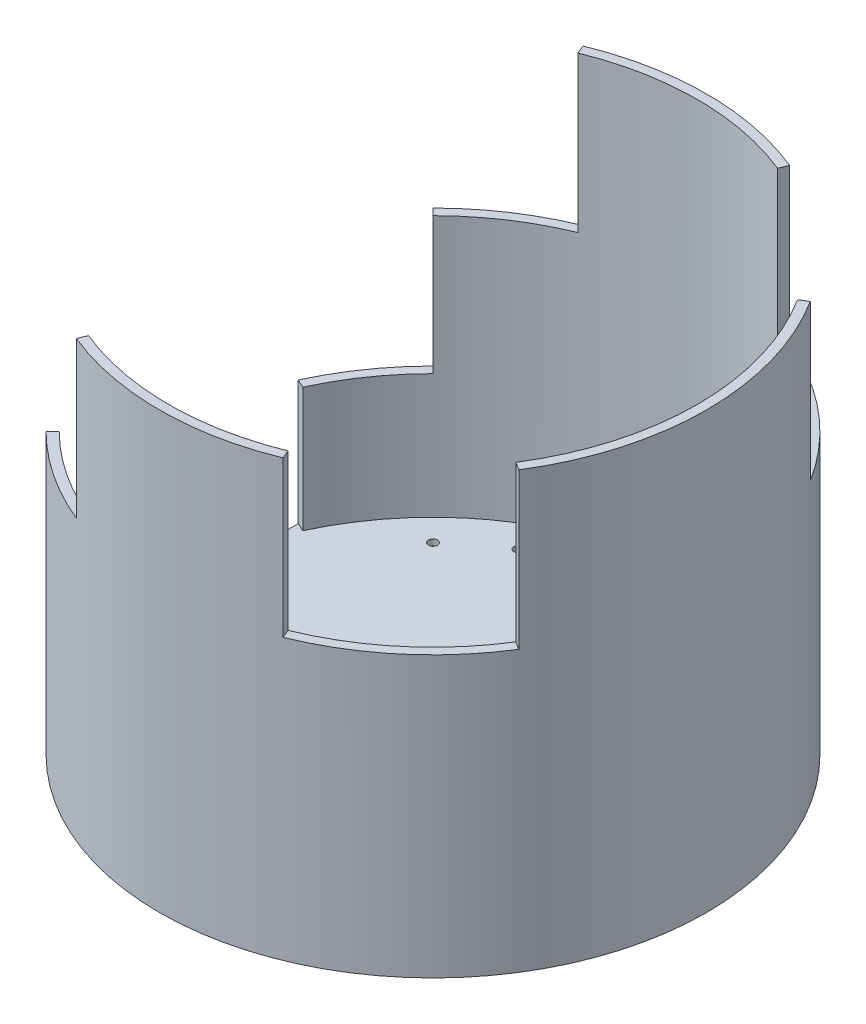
ISO-10303-21;
HEADER;
FILE_DESCRIPTION(('STEP AP214'),'2;1');
FILE_NAME('part.step','',(''),(''),'','','');
FILE_SCHEMA(('AUTOMOTIVE_DESIGN { 1 0 10303 214 1 1 1 1 }'));
ENDSEC;
DATA;
#1=APPLICATION_CONTEXT('core data for automotive mechanical design processes');
#2=APPLICATION_PROTOCOL_DEFINITION('international standard','automotive_design',2000,#1);
#3=PRODUCT_CONTEXT('',#1,'mechanical');
#4=PRODUCT('Part','Part','',(#3));
#5=PRODUCT_RELATED_PRODUCT_CATEGORY('part','',(#4));
#6=PRODUCT_DEFINITION_FORMATION('','',#4);
#7=PRODUCT_DEFINITION_CONTEXT('part definition',#1,'design');
#8=PRODUCT_DEFINITION('design','',#6,#7);
#9=PRODUCT_DEFINITION_SHAPE('','',#8);
#10=(LENGTH_UNIT() NAMED_UNIT(*) SI_UNIT(.MILLI.,.METRE.));
#11=(NAMED_UNIT(*) PLANE_ANGLE_UNIT() SI_UNIT($,.RADIAN.));
#12=(NAMED_UNIT(*) SI_UNIT($,.STERADIAN.) SOLID_ANGLE_UNIT());
#13=UNCERTAINTY_MEASURE_WITH_UNIT(LENGTH_MEASURE(1.E-05),#10,'distance_accuracy_value','');
#14=(GEOMETRIC_REPRESENTATION_CONTEXT(3) GLOBAL_UNCERTAINTY_ASSIGNED_CONTEXT((#13)) GLOBAL_UNIT_ASSIGNED_CONTEXT((#10,
#11,#12)) REPRESENTATION_CONTEXT('',''));
#15=CARTESIAN_POINT('',(0.,0.,0.));
#16=DIRECTION('',(0.,0.,1.));
#17=DIRECTION('',(1.,0.,0.));
#18=AXIS2_PLACEMENT_3D('',#15,#16,#17);
#19=CARTESIAN_POINT('',(-80.,159.371915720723,36.6606055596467));
#20=DIRECTION('',(1.,0.,0.));
#21=DIRECTION('',(0.,0.,-1.));
#22=AXIS2_PLACEMENT_3D('',#19,#20,#21);
#23=PLANE('',#22);
#24=DIRECTION('',(0.,0.,-1.));
#25=VECTOR('',#24,1.);
#26=CARTESIAN_POINT('',(-80.,6.00000000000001,-36.6606055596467));
#27=LINE('',#26,#25);
#28=CARTESIAN_POINT('',(-80.,6.00000000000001,36.6606055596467));
#29=VERTEX_POINT('',#28);
#30=CARTESIAN_POINT('',(-80.,5.99999999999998,-36.6606055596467));
#31=VERTEX_POINT('',#30);
#32=EDGE_CURVE('E227',#29,#31,#27,.T.);
#33=ORIENTED_EDGE('',*,*,#32,.T.);
#34=DIRECTION('',(0.,1.,0.));
#35=VECTOR('',#34,1.);
#36=CARTESIAN_POINT('',(-80.,0.,-36.6606055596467));
#37=LINE('',#36,#35);
#38=CARTESIAN_POINT('',(-80.,0.,-36.6606055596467));
#39=VERTEX_POINT('',#38);
#40=EDGE_CURVE('E288',#39,#31,#37,.T.);
#41=ORIENTED_EDGE('',*,*,#40,.F.);
#42=DIRECTION('',(0.,0.,1.));
#43=VECTOR('',#42,1.);
#44=CARTESIAN_POINT('',(-80.,0.,36.6606055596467));
#45=LINE('',#44,#43);
#46=CARTESIAN_POINT('',(-80.,0.,36.6606055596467));
#47=VERTEX_POINT('',#46);
#48=EDGE_CURVE('E279',#39,#47,#45,.T.);
#49=ORIENTED_EDGE('',*,*,#48,.T.);
#50=DIRECTION('',(0.,1.,0.));
#51=VECTOR('',#50,1.);
#52=CARTESIAN_POINT('',(-80.,0.,36.6606055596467));
#53=LINE('',#52,#51);
#54=EDGE_CURVE('E283',#47,#29,#53,.T.);
#55=ORIENTED_EDGE('',*,*,#54,.T.);
#56=EDGE_LOOP('',(#33,#41,#49,#55));
#57=FACE_BOUND('',#56,.T.);
#58=ADVANCED_FACE('F40',(#57),#23,.F.);
#59=CARTESIAN_POINT('',(0.,46.,0.));
#60=DIRECTION('',(0.,1.,0.));
#61=DIRECTION('',(0.,0.,1.));
#62=AXIS2_PLACEMENT_3D('',#59,#60,#61);
#63=PLANE('',#62);
#64=DIRECTION('',(0.909090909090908,0.,-0.416597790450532));
#65=VECTOR('',#64,1.);
#66=CARTESIAN_POINT('',(-80.,46.,36.6606055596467));
#67=LINE('',#66,#65);
#68=CARTESIAN_POINT('',(-80.,46.,36.6606055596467));
#69=VERTEX_POINT('',#68);
#70=CARTESIAN_POINT('',(-77.2727272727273,46.,35.4108121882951));
#71=VERTEX_POINT('',#70);
#72=EDGE_CURVE('E238',#69,#71,#67,.T.);
#73=ORIENTED_EDGE('',*,*,#72,.F.);
#74=CARTESIAN_POINT('',(0.,46.,0.));
#75=DIRECTION('',(0.,1.,0.));
#76=DIRECTION('',(0.,0.,1.));
#77=AXIS2_PLACEMENT_3D('',#74,#75,#76);
#78=CIRCLE('',#77,88.);
#79=CARTESIAN_POINT('',(-62.2253967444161,46.,62.2253967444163));
#80=VERTEX_POINT('',#79);
#81=EDGE_CURVE('E259',#69,#80,#78,.T.);
#82=ORIENTED_EDGE('',*,*,#81,.T.);
#83=DIRECTION('',(-0.707106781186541,0.,0.707106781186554));
#84=VECTOR('',#83,1.);
#85=CARTESIAN_POINT('',(-60.1040764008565,46.,60.1040764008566));
#86=LINE('',#85,#84);
#87=CARTESIAN_POINT('',(-60.1040764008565,46.,60.1040764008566));
#88=VERTEX_POINT('',#87);
#89=EDGE_CURVE('E254',#88,#80,#86,.T.);
#90=ORIENTED_EDGE('',*,*,#89,.F.);
#91=CARTESIAN_POINT('',(0.,46.,0.));
#92=DIRECTION('',(0.,1.,0.));
#93=DIRECTION('',(0.,0.,1.));
#94=AXIS2_PLACEMENT_3D('',#91,#92,#93);
#95=CIRCLE('',#94,85.);
#96=EDGE_CURVE('E275',#71,#88,#95,.T.);
#97=ORIENTED_EDGE('',*,*,#96,.F.);
#98=EDGE_LOOP('',(#73,#82,#90,#97));
#99=FACE_BOUND('',#98,.T.);
#100=ADVANCED_FACE('F487',(#99),#63,.T.);
#101=CARTESIAN_POINT('',(0.,140.,0.));
#102=DIRECTION('',(0.,1.,0.));
#103=DIRECTION('',(0.,0.,1.));
#104=AXIS2_PLACEMENT_3D('',#101,#102,#103);
#105=PLANE('',#104);
#106=DIRECTION('',(0.84629783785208,0.,-0.532710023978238));
#107=VECTOR('',#106,1.);
#108=CARTESIAN_POINT('',(78.2235162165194,140.,-49.2385178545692));
#109=LINE('',#108,#107);
#110=CARTESIAN_POINT('',(71.9353162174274,140.,-45.2803520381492));
#111=VERTEX_POINT('',#110);
#112=CARTESIAN_POINT('',(74.4742097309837,140.,-46.8784821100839));
#113=VERTEX_POINT('',#112);
#114=EDGE_CURVE('E316',#111,#113,#109,.T.);
#115=ORIENTED_EDGE('',*,*,#114,.F.);
#116=CARTESIAN_POINT('',(0.,140.,0.));
#117=DIRECTION('',(0.,1.,0.));
#118=DIRECTION('',(0.,0.,1.));
#119=AXIS2_PLACEMENT_3D('',#116,#117,#118);
#120=CIRCLE('',#119,85.);
#121=CARTESIAN_POINT('',(71.9353162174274,140.,45.2803520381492));
#122=VERTEX_POINT('',#121);
#123=EDGE_CURVE('E399',#122,#111,#120,.T.);
#124=ORIENTED_EDGE('',*,*,#123,.F.);
#125=DIRECTION('',(-0.84629783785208,0.,-0.532710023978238));
#126=VECTOR('',#125,1.);
#127=CARTESIAN_POINT('',(78.2235162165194,140.,49.2385178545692));
#128=LINE('',#127,#126);
#129=CARTESIAN_POINT('',(74.4742097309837,140.,46.8784821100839));
#130=VERTEX_POINT('',#129);
#131=EDGE_CURVE('E325',#130,#122,#128,.T.);
#132=ORIENTED_EDGE('',*,*,#131,.F.);
#133=CARTESIAN_POINT('',(0.,140.,0.));
#134=DIRECTION('',(0.,1.,0.));
#135=DIRECTION('',(0.,0.,1.));
#136=AXIS2_PLACEMENT_3D('',#133,#134,#135);
#137=CIRCLE('',#136,88.);
#138=EDGE_CURVE('E405',#130,#113,#137,.T.);
#139=ORIENTED_EDGE('',*,*,#138,.T.);
#140=EDGE_LOOP('',(#115,#124,#132,#139));
#141=FACE_BOUND('',#140,.T.);
#142=ADVANCED_FACE('F495',(#141),#105,.T.);
#143=DIRECTION('',(0.377658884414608,0.,-0.925944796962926));
#144=VECTOR('',#143,1.);
#145=CARTESIAN_POINT('',(-34.9071030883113,140.,85.5853041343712));
#146=LINE('',#145,#144);
#147=CARTESIAN_POINT('',(-33.2339818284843,140.,81.4831421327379));
#148=VERTEX_POINT('',#147);
#149=CARTESIAN_POINT('',(-32.1010051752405,140.,78.7053077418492));
#150=VERTEX_POINT('',#149);
#151=EDGE_CURVE('E307',#148,#150,#146,.T.);
#152=ORIENTED_EDGE('',*,*,#151,.F.);
#153=CARTESIAN_POINT('',(33.2339818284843,140.,81.4831421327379));
#154=VERTEX_POINT('',#153);
#155=EDGE_CURVE('E400',#148,#154,#137,.T.);
#156=ORIENTED_EDGE('',*,*,#155,.T.);
#157=DIRECTION('',(0.377658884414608,0.,0.925944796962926));
#158=VECTOR('',#157,1.);
#159=CARTESIAN_POINT('',(34.9071030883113,140.,85.5853041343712));
#160=LINE('',#159,#158);
#161=CARTESIAN_POINT('',(32.1010051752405,140.,78.7053077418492));
#162=VERTEX_POINT('',#161);
#163=EDGE_CURVE('E342',#162,#154,#160,.T.);
#164=ORIENTED_EDGE('',*,*,#163,.F.);
#165=EDGE_CURVE('E394',#150,#162,#120,.T.);
#166=ORIENTED_EDGE('',*,*,#165,.F.);
#167=EDGE_LOOP('',(#152,#156,#164,#166));
#168=FACE_BOUND('',#167,.T.);
#169=ADVANCED_FACE('F552',(#168),#105,.T.);
#170=DIRECTION('',(-0.377658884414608,0.,0.925944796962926));
#171=VECTOR('',#170,1.);
#172=CARTESIAN_POINT('',(34.9071030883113,140.,-85.5853041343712));
#173=LINE('',#172,#171);
#174=CARTESIAN_POINT('',(33.2339818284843,140.,-81.4831421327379));
#175=VERTEX_POINT('',#174);
#176=CARTESIAN_POINT('',(32.1010051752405,140.,-78.7053077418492));
#177=VERTEX_POINT('',#176);
#178=EDGE_CURVE('E313',#175,#177,#173,.T.);
#179=ORIENTED_EDGE('',*,*,#178,.F.);
#180=CARTESIAN_POINT('',(-33.2339818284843,140.,-81.4831421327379));
#181=VERTEX_POINT('',#180);
#182=EDGE_CURVE('E404',#175,#181,#137,.T.);
#183=ORIENTED_EDGE('',*,*,#182,.T.);
#184=DIRECTION('',(-0.377658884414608,0.,-0.925944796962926));
#185=VECTOR('',#184,1.);
#186=CARTESIAN_POINT('',(-34.9071030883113,140.,-85.5853041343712));
#187=LINE('',#186,#185);
#188=CARTESIAN_POINT('',(-32.1010051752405,140.,-78.7053077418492));
#189=VERTEX_POINT('',#188);
#190=EDGE_CURVE('E287',#189,#181,#187,.T.);
#191=ORIENTED_EDGE('',*,*,#190,.F.);
#192=EDGE_CURVE('E398',#177,#189,#120,.T.);
#193=ORIENTED_EDGE('',*,*,#192,.F.);
#194=EDGE_LOOP('',(#179,#183,#191,#193));
#195=FACE_BOUND('',#194,.T.);
#196=ADVANCED_FACE('F554',(#195),#105,.T.);
#197=CARTESIAN_POINT('',(0.,6.,0.));
#198=DIRECTION('',(0.,-1.,0.));
#199=DIRECTION('',(0.,0.,-1.));
#200=AXIS2_PLACEMENT_3D('',#197,#198,#199);
#201=CYLINDRICAL_SURFACE('',#200,88.);
#202=CARTESIAN_POINT('',(-62.2253967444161,46.,-62.2253967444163));
#203=VERTEX_POINT('',#202);
#204=CARTESIAN_POINT('',(-80.,46.,-36.6606055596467));
#205=VERTEX_POINT('',#204);
#206=EDGE_CURVE('E274',#203,#205,#78,.T.);
#207=ORIENTED_EDGE('',*,*,#206,.F.);
#208=DIRECTION('',(0.,1.,0.));
#209=VECTOR('',#208,1.);
#210=CARTESIAN_POINT('',(-62.2253967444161,-80.0311381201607,-62.2253967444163));
#211=LINE('',#210,#209);
#212=CARTESIAN_POINT('',(-62.2253967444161,90.,-62.2253967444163));
#213=VERTEX_POINT('',#212);
#214=EDGE_CURVE('E262',#203,#213,#211,.T.);
#215=ORIENTED_EDGE('',*,*,#214,.T.);
#216=CARTESIAN_POINT('',(0.,90.,0.));
#217=DIRECTION('',(0.,1.,0.));
#218=DIRECTION('',(0.,0.,1.));
#219=AXIS2_PLACEMENT_3D('',#216,#217,#218);
#220=CIRCLE('',#219,88.);
#221=CARTESIAN_POINT('',(-33.2339818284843,90.,-81.4831421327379));
#222=VERTEX_POINT('',#221);
#223=EDGE_CURVE('E368',#222,#213,#220,.T.);
#224=ORIENTED_EDGE('',*,*,#223,.F.);
#225=DIRECTION('',(0.,-1.,0.));
#226=VECTOR('',#225,1.);
#227=CARTESIAN_POINT('',(-33.2339818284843,6.,-81.4831421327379));
#228=LINE('',#227,#226);
#229=EDGE_CURVE('E372',#222,#181,#228,.F.);
#230=ORIENTED_EDGE('',*,*,#229,.T.);
#231=ORIENTED_EDGE('',*,*,#182,.F.);
#232=DIRECTION('',(0.,-1.,0.));
#233=VECTOR('',#232,1.);
#234=CARTESIAN_POINT('',(33.2339818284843,6.,-81.4831421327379));
#235=LINE('',#234,#233);
#236=CARTESIAN_POINT('',(33.2339818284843,90.,-81.4831421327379));
#237=VERTEX_POINT('',#236);
#238=EDGE_CURVE('E386',#175,#237,#235,.T.);
#239=ORIENTED_EDGE('',*,*,#238,.T.);
#240=CARTESIAN_POINT('',(0.,90.,0.));
#241=DIRECTION('',(0.,1.,0.));
#242=DIRECTION('',(0.,0.,1.));
#243=AXIS2_PLACEMENT_3D('',#240,#241,#242);
#244=CIRCLE('',#243,88.);
#245=CARTESIAN_POINT('',(74.4742097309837,90.,-46.8784821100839));
#246=VERTEX_POINT('',#245);
#247=EDGE_CURVE('E383',#246,#237,#244,.T.);
#248=ORIENTED_EDGE('',*,*,#247,.F.);
#249=DIRECTION('',(0.,-1.,0.));
#250=VECTOR('',#249,1.);
#251=CARTESIAN_POINT('',(74.4742097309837,6.,-46.8784821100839));
#252=LINE('',#251,#250);
#253=EDGE_CURVE('E390',#246,#113,#252,.F.);
#254=ORIENTED_EDGE('',*,*,#253,.T.);
#255=ORIENTED_EDGE('',*,*,#138,.F.);
#256=DIRECTION('',(0.,-1.,0.));
#257=VECTOR('',#256,1.);
#258=CARTESIAN_POINT('',(74.4742097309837,6.,46.8784821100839));
#259=LINE('',#258,#257);
#260=CARTESIAN_POINT('',(74.4742097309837,90.,46.8784821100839));
#261=VERTEX_POINT('',#260);
#262=EDGE_CURVE('E360',#130,#261,#259,.T.);
#263=ORIENTED_EDGE('',*,*,#262,.T.);
#264=CARTESIAN_POINT('',(0.,90.,0.));
#265=DIRECTION('',(0.,1.,0.));
#266=DIRECTION('',(0.,0.,1.));
#267=AXIS2_PLACEMENT_3D('',#264,#265,#266);
#268=CIRCLE('',#267,88.);
#269=CARTESIAN_POINT('',(33.2339818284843,90.,81.4831421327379));
#270=VERTEX_POINT('',#269);
#271=EDGE_CURVE('E354',#270,#261,#268,.T.);
#272=ORIENTED_EDGE('',*,*,#271,.F.);
#273=DIRECTION('',(0.,-1.,0.));
#274=VECTOR('',#273,1.);
#275=CARTESIAN_POINT('',(33.2339818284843,6.,81.4831421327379));
#276=LINE('',#275,#274);
#277=EDGE_CURVE('E364',#270,#154,#276,.F.);
#278=ORIENTED_EDGE('',*,*,#277,.T.);
#279=ORIENTED_EDGE('',*,*,#155,.F.);
#280=DIRECTION('',(0.,-1.,0.));
#281=VECTOR('',#280,1.);
#282=CARTESIAN_POINT('',(-33.2339818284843,6.,81.4831421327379));
#283=LINE('',#282,#281);
#284=CARTESIAN_POINT('',(-33.2339818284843,90.,81.4831421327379));
#285=VERTEX_POINT('',#284);
#286=EDGE_CURVE('E379',#148,#285,#283,.T.);
#287=ORIENTED_EDGE('',*,*,#286,.T.);
#288=CARTESIAN_POINT('',(0.,90.,0.));
#289=DIRECTION('',(0.,1.,0.));
#290=DIRECTION('',(0.,0.,1.));
#291=AXIS2_PLACEMENT_3D('',#288,#289,#290);
#292=CIRCLE('',#291,88.);
#293=CARTESIAN_POINT('',(-62.2253967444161,90.,62.2253967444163));
#294=VERTEX_POINT('',#293);
#295=EDGE_CURVE('E376',#294,#285,#292,.T.);
#296=ORIENTED_EDGE('',*,*,#295,.F.);
#297=DIRECTION('',(0.,1.,0.));
#298=VECTOR('',#297,1.);
#299=CARTESIAN_POINT('',(-62.2253967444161,-80.0311381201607,62.2253967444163));
#300=LINE('',#299,#298);
#301=EDGE_CURVE('E255',#80,#294,#300,.T.);
#302=ORIENTED_EDGE('',*,*,#301,.F.);
#303=ORIENTED_EDGE('',*,*,#81,.F.);
#304=DIRECTION('',(0.,1.,0.));
#305=VECTOR('',#304,1.);
#306=CARTESIAN_POINT('',(-80.,-67.3719157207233,36.6606055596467));
#307=LINE('',#306,#305);
#308=EDGE_CURVE('E232',#29,#69,#307,.T.);
#309=ORIENTED_EDGE('',*,*,#308,.F.);
#310=ORIENTED_EDGE('',*,*,#54,.F.);
#311=CARTESIAN_POINT('',(0.,0.,0.));
#312=DIRECTION('',(0.,1.,0.));
#313=DIRECTION('',(0.,0.,1.));
#314=AXIS2_PLACEMENT_3D('',#311,#312,#313);
#315=CIRCLE('',#314,88.);
#316=EDGE_CURVE('E406',#47,#39,#315,.T.);
#317=ORIENTED_EDGE('',*,*,#316,.T.);
#318=ORIENTED_EDGE('',*,*,#40,.T.);
#319=DIRECTION('',(0.,1.,0.));
#320=VECTOR('',#319,1.);
#321=CARTESIAN_POINT('',(-80.,-67.3719157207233,-36.6606055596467));
#322=LINE('',#321,#320);
#323=EDGE_CURVE('E241',#31,#205,#322,.T.);
#324=ORIENTED_EDGE('',*,*,#323,.T.);
#325=EDGE_LOOP('',(#207,#215,#224,#230,#231,#239,#248,#254,#255,#263,#272,#278,#279,#287,#296,
#302,#303,#309,#310,#317,#318,#324));
#326=FACE_BOUND('',#325,.T.);
#327=ADVANCED_FACE('F42',(#326),#201,.T.);
#328=CARTESIAN_POINT('',(0.,0.,0.));
#329=DIRECTION('',(0.,1.,0.));
#330=DIRECTION('',(0.,0.,1.));
#331=AXIS2_PLACEMENT_3D('',#328,#329,#330);
#332=PLANE('',#331);
#333=DIRECTION('',(0.,0.,-1.));
#334=VECTOR('',#333,1.);
#335=CARTESIAN_POINT('',(-55.,0.,-64.8074069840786));
#336=LINE('',#335,#334);
#337=CARTESIAN_POINT('',(-55.,0.,64.8074069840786));
#338=VERTEX_POINT('',#337);
#339=CARTESIAN_POINT('',(-55.,0.,-64.8074069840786));
#340=VERTEX_POINT('',#339);
#341=EDGE_CURVE('E212',#338,#340,#336,.T.);
#342=ORIENTED_EDGE('',*,*,#341,.F.);
#343=CARTESIAN_POINT('',(0.,0.,0.));
#344=DIRECTION('',(0.,-1.,0.));
#345=DIRECTION('',(0.,0.,-1.));
#346=AXIS2_PLACEMENT_3D('',#343,#344,#345);
#347=CIRCLE('',#346,85.);
#348=EDGE_CURVE('E58',#340,#338,#347,.T.);
#349=ORIENTED_EDGE('',*,*,#348,.F.);
#350=EDGE_LOOP('',(#342,#349));
#351=FACE_BOUND('',#350,.T.);
#352=ORIENTED_EDGE('',*,*,#48,.F.);
#353=ORIENTED_EDGE('',*,*,#316,.F.);
#354=EDGE_LOOP('',(#352,#353));
#355=FACE_BOUND('',#354,.T.);
#356=ADVANCED_FACE('F548',(#351,#355),#332,.F.);
#357=CARTESIAN_POINT('',(0.,140.,0.));
#358=DIRECTION('',(0.,-1.,0.));
#359=DIRECTION('',(0.,0.,-1.));
#360=AXIS2_PLACEMENT_3D('',#357,#358,#359);
#361=CYLINDRICAL_SURFACE('',#360,85.);
#362=DIRECTION('',(0.,1.,0.));
#363=VECTOR('',#362,1.);
#364=CARTESIAN_POINT('',(-60.1040764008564,-80.0311381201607,-60.1040764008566));
#365=LINE('',#364,#363);
#366=CARTESIAN_POINT('',(-60.1040764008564,45.9999999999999,-60.1040764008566));
#367=VERTEX_POINT('',#366);
#368=CARTESIAN_POINT('',(-60.1040764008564,90.,-60.1040764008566));
#369=VERTEX_POINT('',#368);
#370=EDGE_CURVE('E266',#367,#369,#365,.T.);
#371=ORIENTED_EDGE('',*,*,#370,.F.);
#372=CARTESIAN_POINT('',(-77.2727272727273,46.,-35.4108121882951));
#373=VERTEX_POINT('',#372);
#374=EDGE_CURVE('E278',#367,#373,#95,.T.);
#375=ORIENTED_EDGE('',*,*,#374,.T.);
#376=DIRECTION('',(0.,1.,0.));
#377=VECTOR('',#376,1.);
#378=CARTESIAN_POINT('',(-77.2727272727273,0.,-35.4108121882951));
#379=LINE('',#378,#377);
#380=CARTESIAN_POINT('',(-77.2727272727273,6.00000000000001,-35.4108121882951));
#381=VERTEX_POINT('',#380);
#382=EDGE_CURVE('E292',#381,#373,#379,.T.);
#383=ORIENTED_EDGE('',*,*,#382,.F.);
#384=CARTESIAN_POINT('',(0.,6.00000000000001,0.));
#385=DIRECTION('',(0.,1.,0.));
#386=DIRECTION('',(0.,0.,1.));
#387=AXIS2_PLACEMENT_3D('',#384,#385,#386);
#388=CIRCLE('',#387,85.);
#389=CARTESIAN_POINT('',(-77.2727272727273,6.00000000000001,35.4108121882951));
#390=VERTEX_POINT('',#389);
#391=EDGE_CURVE('E410',#381,#390,#388,.F.);
#392=ORIENTED_EDGE('',*,*,#391,.T.);
#393=DIRECTION('',(0.,1.,0.));
#394=VECTOR('',#393,1.);
#395=CARTESIAN_POINT('',(-77.2727272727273,0.,35.4108121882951));
#396=LINE('',#395,#394);
#397=EDGE_CURVE('E282',#390,#71,#396,.T.);
#398=ORIENTED_EDGE('',*,*,#397,.T.);
#399=ORIENTED_EDGE('',*,*,#96,.T.);
#400=DIRECTION('',(0.,1.,0.));
#401=VECTOR('',#400,1.);
#402=CARTESIAN_POINT('',(-60.1040764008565,-80.0311381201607,60.1040764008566));
#403=LINE('',#402,#401);
#404=CARTESIAN_POINT('',(-60.1040764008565,90.,60.1040764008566));
#405=VERTEX_POINT('',#404);
#406=EDGE_CURVE('E249',#88,#405,#403,.T.);
#407=ORIENTED_EDGE('',*,*,#406,.T.);
#408=CARTESIAN_POINT('',(0.,90.,0.));
#409=DIRECTION('',(0.,1.,0.));
#410=DIRECTION('',(0.,0.,1.));
#411=AXIS2_PLACEMENT_3D('',#408,#409,#410);
#412=CIRCLE('',#411,85.);
#413=CARTESIAN_POINT('',(-32.1010051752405,90.,78.7053077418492));
#414=VERTEX_POINT('',#413);
#415=EDGE_CURVE('E422',#405,#414,#412,.T.);
#416=ORIENTED_EDGE('',*,*,#415,.T.);
#417=DIRECTION('',(0.,1.,0.));
#418=VECTOR('',#417,1.);
#419=CARTESIAN_POINT('',(-32.1010051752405,90.,78.7053077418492));
#420=LINE('',#419,#418);
#421=EDGE_CURVE('E319',#414,#150,#420,.T.);
#422=ORIENTED_EDGE('',*,*,#421,.T.);
#423=ORIENTED_EDGE('',*,*,#165,.T.);
#424=DIRECTION('',(0.,1.,0.));
#425=VECTOR('',#424,1.);
#426=CARTESIAN_POINT('',(32.1010051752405,90.,78.7053077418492));
#427=LINE('',#426,#425);
#428=CARTESIAN_POINT('',(32.1010051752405,90.,78.7053077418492));
#429=VERTEX_POINT('',#428);
#430=EDGE_CURVE('E351',#429,#162,#427,.T.);
#431=ORIENTED_EDGE('',*,*,#430,.F.);
#432=CARTESIAN_POINT('',(0.,90.,0.));
#433=DIRECTION('',(0.,1.,0.));
#434=DIRECTION('',(0.,0.,1.));
#435=AXIS2_PLACEMENT_3D('',#432,#433,#434);
#436=CIRCLE('',#435,85.);
#437=CARTESIAN_POINT('',(71.9353162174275,90.,45.2803520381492));
#438=VERTEX_POINT('',#437);
#439=EDGE_CURVE('E414',#429,#438,#436,.T.);
#440=ORIENTED_EDGE('',*,*,#439,.T.);
#441=DIRECTION('',(0.,1.,0.));
#442=VECTOR('',#441,1.);
#443=CARTESIAN_POINT('',(71.9353162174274,90.,45.2803520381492));
#444=LINE('',#443,#442);
#445=EDGE_CURVE('E346',#438,#122,#444,.T.);
#446=ORIENTED_EDGE('',*,*,#445,.T.);
#447=ORIENTED_EDGE('',*,*,#123,.T.);
#448=DIRECTION('',(0.,1.,0.));
#449=VECTOR('',#448,1.);
#450=CARTESIAN_POINT('',(71.9353162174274,90.,-45.2803520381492));
#451=LINE('',#450,#449);
#452=CARTESIAN_POINT('',(71.9353162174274,90.,-45.2803520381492));
#453=VERTEX_POINT('',#452);
#454=EDGE_CURVE('E322',#453,#111,#451,.T.);
#455=ORIENTED_EDGE('',*,*,#454,.F.);
#456=CARTESIAN_POINT('',(0.,90.,0.));
#457=DIRECTION('',(0.,1.,0.));
#458=DIRECTION('',(0.,0.,1.));
#459=AXIS2_PLACEMENT_3D('',#456,#457,#458);
#460=CIRCLE('',#459,85.);
#461=CARTESIAN_POINT('',(32.1010051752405,90.,-78.7053077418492));
#462=VERTEX_POINT('',#461);
#463=EDGE_CURVE('E425',#453,#462,#460,.T.);
#464=ORIENTED_EDGE('',*,*,#463,.T.);
#465=DIRECTION('',(0.,1.,0.));
#466=VECTOR('',#465,1.);
#467=CARTESIAN_POINT('',(32.1010051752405,90.,-78.7053077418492));
#468=LINE('',#467,#466);
#469=EDGE_CURVE('E66',#462,#177,#468,.T.);
#470=ORIENTED_EDGE('',*,*,#469,.T.);
#471=ORIENTED_EDGE('',*,*,#192,.T.);
#472=DIRECTION('',(0.,1.,0.));
#473=VECTOR('',#472,1.);
#474=CARTESIAN_POINT('',(-32.1010051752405,90.,-78.7053077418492));
#475=LINE('',#474,#473);
#476=CARTESIAN_POINT('',(-32.1010051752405,90.,-78.7053077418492));
#477=VERTEX_POINT('',#476);
#478=EDGE_CURVE('E302',#477,#189,#475,.T.);
#479=ORIENTED_EDGE('',*,*,#478,.F.);
#480=CARTESIAN_POINT('',(0.,90.,0.));
#481=DIRECTION('',(0.,1.,0.));
#482=DIRECTION('',(0.,0.,1.));
#483=AXIS2_PLACEMENT_3D('',#480,#481,#482);
#484=CIRCLE('',#483,85.);
#485=EDGE_CURVE('E418',#477,#369,#484,.T.);
#486=ORIENTED_EDGE('',*,*,#485,.T.);
#487=EDGE_LOOP('',(#371,#375,#383,#392,#398,#399,#407,#416,#422,#423,#431,#440,#446,#447,#455,
#464,#470,#471,#479,#486));
#488=FACE_BOUND('',#487,.T.);
#489=ADVANCED_FACE('F545',(#488),#361,.F.);
#490=CARTESIAN_POINT('',(0.,6.,0.));
#491=DIRECTION('',(0.,1.,0.));
#492=DIRECTION('',(0.,0.,1.));
#493=AXIS2_PLACEMENT_3D('',#490,#491,#492);
#494=PLANE('',#493);
#495=CARTESIAN_POINT('',(-53.0330085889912,6.,-53.033008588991));
#496=DIRECTION('',(0.,1.,0.));
#497=DIRECTION('',(0.,0.,1.));
#498=AXIS2_PLACEMENT_3D('',#495,#496,#497);
#499=CIRCLE('',#498,1.44999999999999);
#500=CARTESIAN_POINT('',(-53.0330085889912,6.,-51.583008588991));
#501=VERTEX_POINT('',#500);
#502=EDGE_CURVE('E748',#501,#501,#499,.T.);
#503=ORIENTED_EDGE('',*,*,#502,.F.);
#504=EDGE_LOOP('',(#503));
#505=FACE_BOUND('',#504,.T.);
#506=CARTESIAN_POINT('',(-37.5000000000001,6.,-64.9519052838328));
#507=DIRECTION('',(0.,1.,0.));
#508=DIRECTION('',(0.,0.,1.));
#509=AXIS2_PLACEMENT_3D('',#506,#507,#508);
#510=CIRCLE('',#509,1.44999999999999);
#511=CARTESIAN_POINT('',(-37.5000000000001,6.,-63.5019052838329));
#512=VERTEX_POINT('',#511);
#513=EDGE_CURVE('E752',#512,#512,#510,.T.);
#514=ORIENTED_EDGE('',*,*,#513,.F.);
#515=EDGE_LOOP('',(#514));
#516=FACE_BOUND('',#515,.T.);
#517=CARTESIAN_POINT('',(37.5000000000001,6.,-64.9519052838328));
#518=DIRECTION('',(0.,1.,0.));
#519=DIRECTION('',(0.,0.,1.));
#520=AXIS2_PLACEMENT_3D('',#517,#518,#519);
#521=CIRCLE('',#520,1.44999999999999);
#522=CARTESIAN_POINT('',(37.5000000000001,6.,-63.5019052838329));
#523=VERTEX_POINT('',#522);
#524=EDGE_CURVE('E758',#523,#523,#521,.T.);
#525=ORIENTED_EDGE('',*,*,#524,.F.);
#526=EDGE_LOOP('',(#525));
#527=FACE_BOUND('',#526,.T.);
#528=CARTESIAN_POINT('',(57.4533332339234,6.,-48.2090707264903));
#529=DIRECTION('',(0.,1.,0.));
#530=DIRECTION('',(0.,0.,1.));
#531=AXIS2_PLACEMENT_3D('',#528,#529,#530);
#532=CIRCLE('',#531,1.44999999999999);
#533=CARTESIAN_POINT('',(57.4533332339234,6.,-46.7590707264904));
#534=VERTEX_POINT('',#533);
#535=EDGE_CURVE('E449',#534,#534,#532,.T.);
#536=ORIENTED_EDGE('',*,*,#535,.F.);
#537=EDGE_LOOP('',(#536));
#538=FACE_BOUND('',#537,.T.);
#539=CARTESIAN_POINT('',(-53.0330085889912,6.,53.033008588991));
#540=DIRECTION('',(0.,1.,0.));
#541=DIRECTION('',(0.,0.,1.));
#542=AXIS2_PLACEMENT_3D('',#539,#540,#541);
#543=CIRCLE('',#542,1.44999999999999);
#544=CARTESIAN_POINT('',(-53.0330085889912,6.,54.4830085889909));
#545=VERTEX_POINT('',#544);
#546=EDGE_CURVE('E434',#545,#545,#543,.T.);
#547=ORIENTED_EDGE('',*,*,#546,.F.);
#548=EDGE_LOOP('',(#547));
#549=FACE_BOUND('',#548,.T.);
#550=CARTESIAN_POINT('',(-37.5000000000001,6.,64.9519052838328));
#551=DIRECTION('',(0.,1.,0.));
#552=DIRECTION('',(0.,0.,1.));
#553=AXIS2_PLACEMENT_3D('',#550,#551,#552);
#554=CIRCLE('',#553,1.44999999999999);
#555=CARTESIAN_POINT('',(-37.5000000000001,6.,66.4019052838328));
#556=VERTEX_POINT('',#555);
#557=EDGE_CURVE('E433',#556,#556,#554,.T.);
#558=ORIENTED_EDGE('',*,*,#557,.F.);
#559=EDGE_LOOP('',(#558));
#560=FACE_BOUND('',#559,.T.);
#561=CARTESIAN_POINT('',(37.5000000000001,6.,64.9519052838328));
#562=DIRECTION('',(0.,1.,0.));
#563=DIRECTION('',(0.,0.,1.));
#564=AXIS2_PLACEMENT_3D('',#561,#562,#563);
#565=CIRCLE('',#564,1.44999999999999);
#566=CARTESIAN_POINT('',(37.5000000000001,6.,66.4019052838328));
#567=VERTEX_POINT('',#566);
#568=EDGE_CURVE('E456',#567,#567,#565,.T.);
#569=ORIENTED_EDGE('',*,*,#568,.F.);
#570=EDGE_LOOP('',(#569));
#571=FACE_BOUND('',#570,.T.);
#572=CARTESIAN_POINT('',(57.4533332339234,6.,48.2090707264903));
#573=DIRECTION('',(0.,1.,0.));
#574=DIRECTION('',(0.,0.,1.));
#575=AXIS2_PLACEMENT_3D('',#572,#573,#574);
#576=CIRCLE('',#575,1.44999999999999);
#577=CARTESIAN_POINT('',(57.4533332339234,6.,49.6590707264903));
#578=VERTEX_POINT('',#577);
#579=EDGE_CURVE('E464',#578,#578,#576,.T.);
#580=ORIENTED_EDGE('',*,*,#579,.F.);
#581=EDGE_LOOP('',(#580));
#582=FACE_BOUND('',#581,.T.);
#583=ORIENTED_EDGE('',*,*,#391,.F.);
#584=DIRECTION('',(0.909090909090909,0.,0.416597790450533));
#585=VECTOR('',#584,1.);
#586=CARTESIAN_POINT('',(-77.2727272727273,6.00000000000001,-35.4108121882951));
#587=LINE('',#586,#585);
#588=EDGE_CURVE('E235',#31,#381,#587,.T.);
#589=ORIENTED_EDGE('',*,*,#588,.F.);
#590=ORIENTED_EDGE('',*,*,#32,.F.);
#591=DIRECTION('',(-0.909090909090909,0.,0.416597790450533));
#592=VECTOR('',#591,1.);
#593=CARTESIAN_POINT('',(-80.,6.00000000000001,36.6606055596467));
#594=LINE('',#593,#592);
#595=EDGE_CURVE('E231',#390,#29,#594,.T.);
#596=ORIENTED_EDGE('',*,*,#595,.F.);
#597=EDGE_LOOP('',(#583,#589,#590,#596));
#598=FACE_BOUND('',#597,.T.);
#599=ADVANCED_FACE('F540',(#505,#516,#527,#538,#549,#560,#571,#582,#598),#494,.T.);
#600=CARTESIAN_POINT('',(34.9071030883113,90.,85.5853041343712));
#601=DIRECTION('',(-0.925944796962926,0.,0.377658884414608));
#602=DIRECTION('',(0.377658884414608,0.,0.925944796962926));
#603=AXIS2_PLACEMENT_3D('',#600,#601,#602);
#604=PLANE('',#603);
#605=DIRECTION('',(0.377658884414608,0.,0.925944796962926));
#606=VECTOR('',#605,1.);
#607=CARTESIAN_POINT('',(34.9071030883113,90.,85.5853041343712));
#608=LINE('',#607,#606);
#609=EDGE_CURVE('E341',#429,#270,#608,.T.);
#610=ORIENTED_EDGE('',*,*,#609,.F.);
#611=ORIENTED_EDGE('',*,*,#430,.T.);
#612=ORIENTED_EDGE('',*,*,#163,.T.);
#613=ORIENTED_EDGE('',*,*,#277,.F.);
#614=EDGE_LOOP('',(#610,#611,#612,#613));
#615=FACE_BOUND('',#614,.T.);
#616=ADVANCED_FACE('F537',(#615),#604,.F.);
#617=CARTESIAN_POINT('',(78.2235162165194,90.,49.2385178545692));
#618=DIRECTION('',(0.532710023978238,0.,-0.84629783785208));
#619=DIRECTION('',(-0.84629783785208,0.,-0.532710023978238));
#620=AXIS2_PLACEMENT_3D('',#617,#618,#619);
#621=PLANE('',#620);
#622=ORIENTED_EDGE('',*,*,#131,.T.);
#623=ORIENTED_EDGE('',*,*,#445,.F.);
#624=DIRECTION('',(-0.84629783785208,0.,-0.532710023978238));
#625=VECTOR('',#624,1.);
#626=CARTESIAN_POINT('',(78.2235162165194,90.,49.2385178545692));
#627=LINE('',#626,#625);
#628=EDGE_CURVE('E337',#261,#438,#627,.T.);
#629=ORIENTED_EDGE('',*,*,#628,.F.);
#630=ORIENTED_EDGE('',*,*,#262,.F.);
#631=EDGE_LOOP('',(#622,#623,#629,#630));
#632=FACE_BOUND('',#631,.T.);
#633=ADVANCED_FACE('F535',(#632),#621,.F.);
#634=CARTESIAN_POINT('',(0.,90.,0.));
#635=DIRECTION('',(0.,1.,0.));
#636=DIRECTION('',(0.,0.,1.));
#637=AXIS2_PLACEMENT_3D('',#634,#635,#636);
#638=PLANE('',#637);
#639=ORIENTED_EDGE('',*,*,#271,.T.);
#640=ORIENTED_EDGE('',*,*,#628,.T.);
#641=ORIENTED_EDGE('',*,*,#439,.F.);
#642=ORIENTED_EDGE('',*,*,#609,.T.);
#643=EDGE_LOOP('',(#639,#640,#641,#642));
#644=FACE_BOUND('',#643,.T.);
#645=ADVANCED_FACE('F514',(#644),#638,.T.);
#646=CARTESIAN_POINT('',(-34.9071030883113,90.,-85.5853041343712));
#647=DIRECTION('',(0.925944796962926,0.,-0.377658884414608));
#648=DIRECTION('',(-0.377658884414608,0.,-0.925944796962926));
#649=AXIS2_PLACEMENT_3D('',#646,#647,#648);
#650=PLANE('',#649);
#651=DIRECTION('',(-0.377658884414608,0.,-0.925944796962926));
#652=VECTOR('',#651,1.);
#653=CARTESIAN_POINT('',(-34.9071030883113,90.,-85.5853041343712));
#654=LINE('',#653,#652);
#655=EDGE_CURVE('E298',#477,#222,#654,.T.);
#656=ORIENTED_EDGE('',*,*,#655,.F.);
#657=ORIENTED_EDGE('',*,*,#478,.T.);
#658=ORIENTED_EDGE('',*,*,#190,.T.);
#659=ORIENTED_EDGE('',*,*,#229,.F.);
#660=EDGE_LOOP('',(#656,#657,#658,#659));
#661=FACE_BOUND('',#660,.T.);
#662=ADVANCED_FACE('F510',(#661),#650,.F.);
#663=CARTESIAN_POINT('',(0.,90.,0.));
#664=DIRECTION('',(0.,1.,0.));
#665=DIRECTION('',(0.,0.,1.));
#666=AXIS2_PLACEMENT_3D('',#663,#664,#665);
#667=PLANE('',#666);
#668=DIRECTION('',(-0.707106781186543,0.,-0.707106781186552));
#669=VECTOR('',#668,1.);
#670=CARTESIAN_POINT('',(0.,90.,0.));
#671=LINE('',#670,#669);
#672=EDGE_CURVE('E12',#369,#213,#671,.T.);
#673=ORIENTED_EDGE('',*,*,#672,.F.);
#674=ORIENTED_EDGE('',*,*,#485,.F.);
#675=ORIENTED_EDGE('',*,*,#655,.T.);
#676=ORIENTED_EDGE('',*,*,#223,.T.);
#677=EDGE_LOOP('',(#673,#674,#675,#676));
#678=FACE_BOUND('',#677,.T.);
#679=ADVANCED_FACE('F506',(#678),#667,.T.);
#680=CARTESIAN_POINT('',(-34.9071030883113,90.,85.5853041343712));
#681=DIRECTION('',(0.925944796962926,0.,0.377658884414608));
#682=DIRECTION('',(0.377658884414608,0.,-0.925944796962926));
#683=AXIS2_PLACEMENT_3D('',#680,#681,#682);
#684=PLANE('',#683);
#685=ORIENTED_EDGE('',*,*,#151,.T.);
#686=ORIENTED_EDGE('',*,*,#421,.F.);
#687=DIRECTION('',(0.377658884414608,0.,-0.925944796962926));
#688=VECTOR('',#687,1.);
#689=CARTESIAN_POINT('',(-34.9071030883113,90.,85.5853041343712));
#690=LINE('',#689,#688);
#691=EDGE_CURVE('E328',#285,#414,#690,.T.);
#692=ORIENTED_EDGE('',*,*,#691,.F.);
#693=ORIENTED_EDGE('',*,*,#286,.F.);
#694=EDGE_LOOP('',(#685,#686,#692,#693));
#695=FACE_BOUND('',#694,.T.);
#696=ADVANCED_FACE('F509',(#695),#684,.F.);
#697=CARTESIAN_POINT('',(0.,90.,0.));
#698=DIRECTION('',(0.,1.,0.));
#699=DIRECTION('',(0.,0.,1.));
#700=AXIS2_PLACEMENT_3D('',#697,#698,#699);
#701=PLANE('',#700);
#702=DIRECTION('',(0.707106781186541,0.,-0.707106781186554));
#703=VECTOR('',#702,1.);
#704=CARTESIAN_POINT('',(0.,90.,0.));
#705=LINE('',#704,#703);
#706=EDGE_CURVE('E50',#294,#405,#705,.T.);
#707=ORIENTED_EDGE('',*,*,#706,.F.);
#708=ORIENTED_EDGE('',*,*,#295,.T.);
#709=ORIENTED_EDGE('',*,*,#691,.T.);
#710=ORIENTED_EDGE('',*,*,#415,.F.);
#711=EDGE_LOOP('',(#707,#708,#709,#710));
#712=FACE_BOUND('',#711,.T.);
#713=ADVANCED_FACE('F525',(#712),#701,.T.);
#714=CARTESIAN_POINT('',(78.2235162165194,90.,-49.2385178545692));
#715=DIRECTION('',(0.532710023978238,0.,0.84629783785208));
#716=DIRECTION('',(0.84629783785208,0.,-0.532710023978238));
#717=AXIS2_PLACEMENT_3D('',#714,#715,#716);
#718=PLANE('',#717);
#719=DIRECTION('',(0.84629783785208,0.,-0.532710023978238));
#720=VECTOR('',#719,1.);
#721=CARTESIAN_POINT('',(78.2235162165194,90.,-49.2385178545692));
#722=LINE('',#721,#720);
#723=EDGE_CURVE('E308',#453,#246,#722,.T.);
#724=ORIENTED_EDGE('',*,*,#723,.F.);
#725=ORIENTED_EDGE('',*,*,#454,.T.);
#726=ORIENTED_EDGE('',*,*,#114,.T.);
#727=ORIENTED_EDGE('',*,*,#253,.F.);
#728=EDGE_LOOP('',(#724,#725,#726,#727));
#729=FACE_BOUND('',#728,.T.);
#730=ADVANCED_FACE('F522',(#729),#718,.F.);
#731=CARTESIAN_POINT('',(34.9071030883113,90.,-85.5853041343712));
#732=DIRECTION('',(-0.925944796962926,0.,-0.377658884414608));
#733=DIRECTION('',(-0.377658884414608,0.,0.925944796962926));
#734=AXIS2_PLACEMENT_3D('',#731,#732,#733);
#735=PLANE('',#734);
#736=ORIENTED_EDGE('',*,*,#178,.T.);
#737=ORIENTED_EDGE('',*,*,#469,.F.);
#738=DIRECTION('',(-0.377658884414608,0.,0.925944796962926));
#739=VECTOR('',#738,1.);
#740=CARTESIAN_POINT('',(34.9071030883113,90.,-85.5853041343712));
#741=LINE('',#740,#739);
#742=EDGE_CURVE('E312',#237,#462,#741,.T.);
#743=ORIENTED_EDGE('',*,*,#742,.F.);
#744=ORIENTED_EDGE('',*,*,#238,.F.);
#745=EDGE_LOOP('',(#736,#737,#743,#744));
#746=FACE_BOUND('',#745,.T.);
#747=ADVANCED_FACE('F518',(#746),#735,.F.);
#748=CARTESIAN_POINT('',(0.,90.,0.));
#749=DIRECTION('',(0.,1.,0.));
#750=DIRECTION('',(0.,0.,1.));
#751=AXIS2_PLACEMENT_3D('',#748,#749,#750);
#752=PLANE('',#751);
#753=ORIENTED_EDGE('',*,*,#247,.T.);
#754=ORIENTED_EDGE('',*,*,#742,.T.);
#755=ORIENTED_EDGE('',*,*,#463,.F.);
#756=ORIENTED_EDGE('',*,*,#723,.T.);
#757=EDGE_LOOP('',(#753,#754,#755,#756));
#758=FACE_BOUND('',#757,.T.);
#759=ADVANCED_FACE('F504',(#758),#752,.T.);
#760=DIRECTION('',(-0.909090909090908,0.,-0.416597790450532));
#761=VECTOR('',#760,1.);
#762=CARTESIAN_POINT('',(-77.2727272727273,46.,-35.4108121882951));
#763=LINE('',#762,#761);
#764=EDGE_CURVE('E225',#373,#205,#763,.T.);
#765=ORIENTED_EDGE('',*,*,#764,.F.);
#766=ORIENTED_EDGE('',*,*,#374,.F.);
#767=DIRECTION('',(0.707106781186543,0.,0.707106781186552));
#768=VECTOR('',#767,1.);
#769=CARTESIAN_POINT('',(-60.1040764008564,46.,-60.1040764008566));
#770=LINE('',#769,#768);
#771=EDGE_CURVE('E250',#203,#367,#770,.T.);
#772=ORIENTED_EDGE('',*,*,#771,.F.);
#773=ORIENTED_EDGE('',*,*,#206,.T.);
#774=EDGE_LOOP('',(#765,#766,#772,#773));
#775=FACE_BOUND('',#774,.T.);
#776=ADVANCED_FACE('F498',(#775),#63,.T.);
#777=CARTESIAN_POINT('',(-60.1040764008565,-80.0311381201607,60.1040764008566));
#778=DIRECTION('',(0.707106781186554,0.,0.707106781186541));
#779=DIRECTION('',(0.707106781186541,0.,-0.707106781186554));
#780=AXIS2_PLACEMENT_3D('',#777,#778,#779);
#781=PLANE('',#780);
#782=ORIENTED_EDGE('',*,*,#706,.T.);
#783=ORIENTED_EDGE('',*,*,#406,.F.);
#784=ORIENTED_EDGE('',*,*,#89,.T.);
#785=ORIENTED_EDGE('',*,*,#301,.T.);
#786=EDGE_LOOP('',(#782,#783,#784,#785));
#787=FACE_BOUND('',#786,.T.);
#788=ADVANCED_FACE('F500',(#787),#781,.F.);
#789=CARTESIAN_POINT('',(-60.1040764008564,-80.0311381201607,-60.1040764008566));
#790=DIRECTION('',(0.707106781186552,0.,-0.707106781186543));
#791=DIRECTION('',(-0.707106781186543,0.,-0.707106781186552));
#792=AXIS2_PLACEMENT_3D('',#789,#790,#791);
#793=PLANE('',#792);
#794=ORIENTED_EDGE('',*,*,#672,.T.);
#795=ORIENTED_EDGE('',*,*,#214,.F.);
#796=ORIENTED_EDGE('',*,*,#771,.T.);
#797=ORIENTED_EDGE('',*,*,#370,.T.);
#798=EDGE_LOOP('',(#794,#795,#796,#797));
#799=FACE_BOUND('',#798,.T.);
#800=ADVANCED_FACE('F642',(#799),#793,.F.);
#801=CARTESIAN_POINT('',(-80.,-67.3719157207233,36.6606055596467));
#802=DIRECTION('',(0.416597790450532,0.,0.909090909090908));
#803=DIRECTION('',(0.909090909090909,0.,-0.416597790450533));
#804=AXIS2_PLACEMENT_3D('',#801,#802,#803);
#805=PLANE('',#804);
#806=ORIENTED_EDGE('',*,*,#595,.T.);
#807=ORIENTED_EDGE('',*,*,#308,.T.);
#808=ORIENTED_EDGE('',*,*,#72,.T.);
#809=ORIENTED_EDGE('',*,*,#397,.F.);
#810=EDGE_LOOP('',(#806,#807,#808,#809));
#811=FACE_BOUND('',#810,.T.);
#812=ADVANCED_FACE('F640',(#811),#805,.F.);
#813=CARTESIAN_POINT('',(-77.2727272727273,-67.3719157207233,-35.4108121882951));
#814=DIRECTION('',(0.416597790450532,0.,-0.909090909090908));
#815=DIRECTION('',(-0.909090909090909,0.,-0.416597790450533));
#816=AXIS2_PLACEMENT_3D('',#813,#814,#815);
#817=PLANE('',#816);
#818=ORIENTED_EDGE('',*,*,#588,.T.);
#819=ORIENTED_EDGE('',*,*,#382,.T.);
#820=ORIENTED_EDGE('',*,*,#764,.T.);
#821=ORIENTED_EDGE('',*,*,#323,.F.);
#822=EDGE_LOOP('',(#818,#819,#820,#821));
#823=FACE_BOUND('',#822,.T.);
#824=ADVANCED_FACE('F578',(#823),#817,.F.);
#825=CARTESIAN_POINT('',(0.,4.,0.));
#826=DIRECTION('',(0.,-1.,0.));
#827=DIRECTION('',(0.,0.,-1.));
#828=AXIS2_PLACEMENT_3D('',#825,#826,#827);
#829=CYLINDRICAL_SURFACE('',#828,85.);
#830=ORIENTED_EDGE('',*,*,#348,.T.);
#831=DIRECTION('',(0.,-1.,0.));
#832=VECTOR('',#831,1.);
#833=CARTESIAN_POINT('',(-55.,4.,64.8074069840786));
#834=LINE('',#833,#832);
#835=CARTESIAN_POINT('',(-55.,4.,64.8074069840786));
#836=VERTEX_POINT('',#835);
#837=EDGE_CURVE('E196',#836,#338,#834,.T.);
#838=ORIENTED_EDGE('',*,*,#837,.F.);
#839=CARTESIAN_POINT('',(0.,4.,0.));
#840=DIRECTION('',(0.,-1.,0.));
#841=DIRECTION('',(0.,0.,-1.));
#842=AXIS2_PLACEMENT_3D('',#839,#840,#841);
#843=CIRCLE('',#842,85.);
#844=CARTESIAN_POINT('',(-55.,4.,-64.8074069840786));
#845=VERTEX_POINT('',#844);
#846=EDGE_CURVE('E199',#845,#836,#843,.T.);
#847=ORIENTED_EDGE('',*,*,#846,.F.);
#848=DIRECTION('',(0.,-1.,0.));
#849=VECTOR('',#848,1.);
#850=CARTESIAN_POINT('',(-55.,4.,-64.8074069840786));
#851=LINE('',#850,#849);
#852=EDGE_CURVE('E206',#845,#340,#851,.T.);
#853=ORIENTED_EDGE('',*,*,#852,.T.);
#854=EDGE_LOOP('',(#830,#838,#847,#853));
#855=FACE_BOUND('',#854,.T.);
#856=ADVANCED_FACE('F198',(#855),#829,.F.);
#857=CARTESIAN_POINT('',(-55.,4.,-64.8074069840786));
#858=DIRECTION('',(-1.,0.,0.));
#859=DIRECTION('',(0.,0.,1.));
#860=AXIS2_PLACEMENT_3D('',#857,#858,#859);
#861=PLANE('',#860);
#862=ORIENTED_EDGE('',*,*,#341,.T.);
#863=ORIENTED_EDGE('',*,*,#852,.F.);
#864=DIRECTION('',(0.,0.,-1.));
#865=VECTOR('',#864,1.);
#866=CARTESIAN_POINT('',(-55.,4.,-64.8074069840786));
#867=LINE('',#866,#865);
#868=EDGE_CURVE('E207',#836,#845,#867,.T.);
#869=ORIENTED_EDGE('',*,*,#868,.F.);
#870=ORIENTED_EDGE('',*,*,#837,.T.);
#871=EDGE_LOOP('',(#862,#863,#869,#870));
#872=FACE_BOUND('',#871,.T.);
#873=ADVANCED_FACE('F214',(#872),#861,.F.);
#874=CARTESIAN_POINT('',(0.,4.,0.));
#875=DIRECTION('',(0.,-1.,0.));
#876=DIRECTION('',(0.,0.,-1.));
#877=AXIS2_PLACEMENT_3D('',#874,#875,#876);
#878=PLANE('',#877);
#879=CARTESIAN_POINT('',(-53.0330085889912,4.,-53.033008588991));
#880=DIRECTION('',(0.,-1.,0.));
#881=DIRECTION('',(0.,0.,-1.));
#882=AXIS2_PLACEMENT_3D('',#879,#880,#881);
#883=CIRCLE('',#882,1.44999999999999);
#884=CARTESIAN_POINT('',(-53.0330085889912,4.,-54.4830085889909));
#885=VERTEX_POINT('',#884);
#886=EDGE_CURVE('E745',#885,#885,#883,.T.);
#887=ORIENTED_EDGE('',*,*,#886,.F.);
#888=EDGE_LOOP('',(#887));
#889=FACE_BOUND('',#888,.T.);
#890=CARTESIAN_POINT('',(-37.5000000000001,4.,-64.9519052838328));
#891=DIRECTION('',(0.,-1.,0.));
#892=DIRECTION('',(0.,0.,-1.));
#893=AXIS2_PLACEMENT_3D('',#890,#891,#892);
#894=CIRCLE('',#893,1.44999999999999);
#895=CARTESIAN_POINT('',(-37.5000000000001,4.,-66.4019052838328));
#896=VERTEX_POINT('',#895);
#897=EDGE_CURVE('E44',#896,#896,#894,.T.);
#898=ORIENTED_EDGE('',*,*,#897,.F.);
#899=EDGE_LOOP('',(#898));
#900=FACE_BOUND('',#899,.T.);
#901=CARTESIAN_POINT('',(37.5000000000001,4.,-64.9519052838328));
#902=DIRECTION('',(0.,-1.,0.));
#903=DIRECTION('',(0.,0.,-1.));
#904=AXIS2_PLACEMENT_3D('',#901,#902,#903);
#905=CIRCLE('',#904,1.44999999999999);
#906=CARTESIAN_POINT('',(37.5000000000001,4.,-66.4019052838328));
#907=VERTEX_POINT('',#906);
#908=EDGE_CURVE('E762',#907,#907,#905,.T.);
#909=ORIENTED_EDGE('',*,*,#908,.F.);
#910=EDGE_LOOP('',(#909));
#911=FACE_BOUND('',#910,.T.);
#912=CARTESIAN_POINT('',(57.4533332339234,4.,-48.2090707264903));
#913=DIRECTION('',(0.,-1.,0.));
#914=DIRECTION('',(0.,0.,-1.));
#915=AXIS2_PLACEMENT_3D('',#912,#913,#914);
#916=CIRCLE('',#915,1.44999999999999);
#917=CARTESIAN_POINT('',(57.4533332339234,4.,-49.6590707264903));
#918=VERTEX_POINT('',#917);
#919=EDGE_CURVE('E443',#918,#918,#916,.T.);
#920=ORIENTED_EDGE('',*,*,#919,.F.);
#921=EDGE_LOOP('',(#920));
#922=FACE_BOUND('',#921,.T.);
#923=CARTESIAN_POINT('',(-53.0330085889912,4.,53.033008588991));
#924=DIRECTION('',(0.,-1.,0.));
#925=DIRECTION('',(0.,0.,-1.));
#926=AXIS2_PLACEMENT_3D('',#923,#924,#925);
#927=CIRCLE('',#926,1.44999999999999);
#928=CARTESIAN_POINT('',(-53.0330085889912,4.,51.583008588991));
#929=VERTEX_POINT('',#928);
#930=EDGE_CURVE('E430',#929,#929,#927,.T.);
#931=ORIENTED_EDGE('',*,*,#930,.F.);
#932=EDGE_LOOP('',(#931));
#933=FACE_BOUND('',#932,.T.);
#934=CARTESIAN_POINT('',(-37.5000000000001,4.,64.9519052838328));
#935=DIRECTION('',(0.,-1.,0.));
#936=DIRECTION('',(0.,0.,-1.));
#937=AXIS2_PLACEMENT_3D('',#934,#935,#936);
#938=CIRCLE('',#937,1.44999999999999);
#939=CARTESIAN_POINT('',(-37.5000000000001,4.,63.5019052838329));
#940=VERTEX_POINT('',#939);
#941=EDGE_CURVE('E440',#940,#940,#938,.T.);
#942=ORIENTED_EDGE('',*,*,#941,.F.);
#943=EDGE_LOOP('',(#942));
#944=FACE_BOUND('',#943,.T.);
#945=CARTESIAN_POINT('',(37.5000000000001,4.,64.9519052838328));
#946=DIRECTION('',(0.,-1.,0.));
#947=DIRECTION('',(0.,0.,-1.));
#948=AXIS2_PLACEMENT_3D('',#945,#946,#947);
#949=CIRCLE('',#948,1.44999999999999);
#950=CARTESIAN_POINT('',(37.5000000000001,4.,63.5019052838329));
#951=VERTEX_POINT('',#950);
#952=EDGE_CURVE('E460',#951,#951,#949,.T.);
#953=ORIENTED_EDGE('',*,*,#952,.F.);
#954=EDGE_LOOP('',(#953));
#955=FACE_BOUND('',#954,.T.);
#956=CARTESIAN_POINT('',(57.4533332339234,4.,48.2090707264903));
#957=DIRECTION('',(0.,-1.,0.));
#958=DIRECTION('',(0.,0.,-1.));
#959=AXIS2_PLACEMENT_3D('',#956,#957,#958);
#960=CIRCLE('',#959,1.44999999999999);
#961=CARTESIAN_POINT('',(57.4533332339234,4.,46.7590707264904));
#962=VERTEX_POINT('',#961);
#963=EDGE_CURVE('E221',#962,#962,#960,.T.);
#964=ORIENTED_EDGE('',*,*,#963,.F.);
#965=EDGE_LOOP('',(#964));
#966=FACE_BOUND('',#965,.T.);
#967=ORIENTED_EDGE('',*,*,#846,.T.);
#968=ORIENTED_EDGE('',*,*,#868,.T.);
#969=EDGE_LOOP('',(#967,#968));
#970=FACE_BOUND('',#969,.T.);
#971=ADVANCED_FACE('F210',(#889,#900,#911,#922,#933,#944,#955,#966,#970),#878,.T.);
#972=CARTESIAN_POINT('',(57.4533332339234,6.,48.2090707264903));
#973=DIRECTION('',(0.,1.,0.));
#974=DIRECTION('',(0.,0.,1.));
#975=AXIS2_PLACEMENT_3D('',#972,#973,#974);
#976=CYLINDRICAL_SURFACE('',#975,1.44999999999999);
#977=ORIENTED_EDGE('',*,*,#963,.T.);
#978=EDGE_LOOP('',(#977));
#979=FACE_BOUND('',#978,.T.);
#980=ORIENTED_EDGE('',*,*,#579,.T.);
#981=EDGE_LOOP('',(#980));
#982=FACE_BOUND('',#981,.T.);
#983=ADVANCED_FACE('F471',(#979,#982),#976,.F.);
#984=CARTESIAN_POINT('',(37.5000000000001,6.,64.9519052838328));
#985=DIRECTION('',(0.,1.,0.));
#986=DIRECTION('',(0.,0.,1.));
#987=AXIS2_PLACEMENT_3D('',#984,#985,#986);
#988=CYLINDRICAL_SURFACE('',#987,1.44999999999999);
#989=ORIENTED_EDGE('',*,*,#952,.T.);
#990=EDGE_LOOP('',(#989));
#991=FACE_BOUND('',#990,.T.);
#992=ORIENTED_EDGE('',*,*,#568,.T.);
#993=EDGE_LOOP('',(#992));
#994=FACE_BOUND('',#993,.T.);
#995=ADVANCED_FACE('F481',(#991,#994),#988,.F.);
#996=CARTESIAN_POINT('',(-37.5000000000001,6.,64.9519052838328));
#997=DIRECTION('',(0.,1.,0.));
#998=DIRECTION('',(0.,0.,1.));
#999=AXIS2_PLACEMENT_3D('',#996,#997,#998);
#1000=CYLINDRICAL_SURFACE('',#999,1.44999999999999);
#1001=ORIENTED_EDGE('',*,*,#941,.T.);
#1002=EDGE_LOOP('',(#1001));
#1003=FACE_BOUND('',#1002,.T.);
#1004=ORIENTED_EDGE('',*,*,#557,.T.);
#1005=EDGE_LOOP('',(#1004));
#1006=FACE_BOUND('',#1005,.T.);
#1007=ADVANCED_FACE('F680',(#1003,#1006),#1000,.F.);
#1008=CARTESIAN_POINT('',(-53.0330085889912,6.,53.033008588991));
#1009=DIRECTION('',(0.,1.,0.));
#1010=DIRECTION('',(0.,0.,1.));
#1011=AXIS2_PLACEMENT_3D('',#1008,#1009,#1010);
#1012=CYLINDRICAL_SURFACE('',#1011,1.44999999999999);
#1013=ORIENTED_EDGE('',*,*,#930,.T.);
#1014=EDGE_LOOP('',(#1013));
#1015=FACE_BOUND('',#1014,.T.);
#1016=ORIENTED_EDGE('',*,*,#546,.T.);
#1017=EDGE_LOOP('',(#1016));
#1018=FACE_BOUND('',#1017,.T.);
#1019=ADVANCED_FACE('F690',(#1015,#1018),#1012,.F.);
#1020=CARTESIAN_POINT('',(57.4533332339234,6.,-48.2090707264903));
#1021=DIRECTION('',(0.,1.,0.));
#1022=DIRECTION('',(0.,0.,1.));
#1023=AXIS2_PLACEMENT_3D('',#1020,#1021,#1022);
#1024=CYLINDRICAL_SURFACE('',#1023,1.44999999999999);
#1025=ORIENTED_EDGE('',*,*,#919,.T.);
#1026=EDGE_LOOP('',(#1025));
#1027=FACE_BOUND('',#1026,.T.);
#1028=ORIENTED_EDGE('',*,*,#535,.T.);
#1029=EDGE_LOOP('',(#1028));
#1030=FACE_BOUND('',#1029,.T.);
#1031=ADVANCED_FACE('F700',(#1027,#1030),#1024,.F.);
#1032=CARTESIAN_POINT('',(37.5000000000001,6.,-64.9519052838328));
#1033=DIRECTION('',(0.,1.,0.));
#1034=DIRECTION('',(0.,0.,1.));
#1035=AXIS2_PLACEMENT_3D('',#1032,#1033,#1034);
#1036=CYLINDRICAL_SURFACE('',#1035,1.44999999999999);
#1037=ORIENTED_EDGE('',*,*,#908,.T.);
#1038=EDGE_LOOP('',(#1037));
#1039=FACE_BOUND('',#1038,.T.);
#1040=ORIENTED_EDGE('',*,*,#524,.T.);
#1041=EDGE_LOOP('',(#1040));
#1042=FACE_BOUND('',#1041,.T.);
#1043=ADVANCED_FACE('F709',(#1039,#1042),#1036,.F.);
#1044=CARTESIAN_POINT('',(-37.5000000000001,6.,-64.9519052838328));
#1045=DIRECTION('',(0.,1.,0.));
#1046=DIRECTION('',(0.,0.,1.));
#1047=AXIS2_PLACEMENT_3D('',#1044,#1045,#1046);
#1048=CYLINDRICAL_SURFACE('',#1047,1.44999999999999);
#1049=ORIENTED_EDGE('',*,*,#897,.T.);
#1050=EDGE_LOOP('',(#1049));
#1051=FACE_BOUND('',#1050,.T.);
#1052=ORIENTED_EDGE('',*,*,#513,.T.);
#1053=EDGE_LOOP('',(#1052));
#1054=FACE_BOUND('',#1053,.T.);
#1055=ADVANCED_FACE('F719',(#1051,#1054),#1048,.F.);
#1056=CARTESIAN_POINT('',(-53.0330085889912,6.,-53.033008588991));
#1057=DIRECTION('',(0.,1.,0.));
#1058=DIRECTION('',(0.,0.,1.));
#1059=AXIS2_PLACEMENT_3D('',#1056,#1057,#1058);
#1060=CYLINDRICAL_SURFACE('',#1059,1.44999999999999);
#1061=ORIENTED_EDGE('',*,*,#886,.T.);
#1062=EDGE_LOOP('',(#1061));
#1063=FACE_BOUND('',#1062,.T.);
#1064=ORIENTED_EDGE('',*,*,#502,.T.);
#1065=EDGE_LOOP('',(#1064));
#1066=FACE_BOUND('',#1065,.T.);
#1067=ADVANCED_FACE('F729',(#1063,#1066),#1060,.F.);
#1068=CLOSED_SHELL('',(#58,#100,#142,#169,#196,#327,#356,#489,#599,#616,#633,#645,#662,#679,
#696,#713,#730,#747,#759,#776,#788,#800,#812,#824,#856,#873,#971,#983,#995,#1007,#1019,#1031,
#1043,#1055,#1067));
#1069=MANIFOLD_SOLID_BREP('B2',#1068);
#1070=ADVANCED_BREP_SHAPE_REPRESENTATION('',(#18,#1069),#14);
#1071=SHAPE_DEFINITION_REPRESENTATION(#9,#1070);
ENDSEC;
END-ISO-10303-21;
